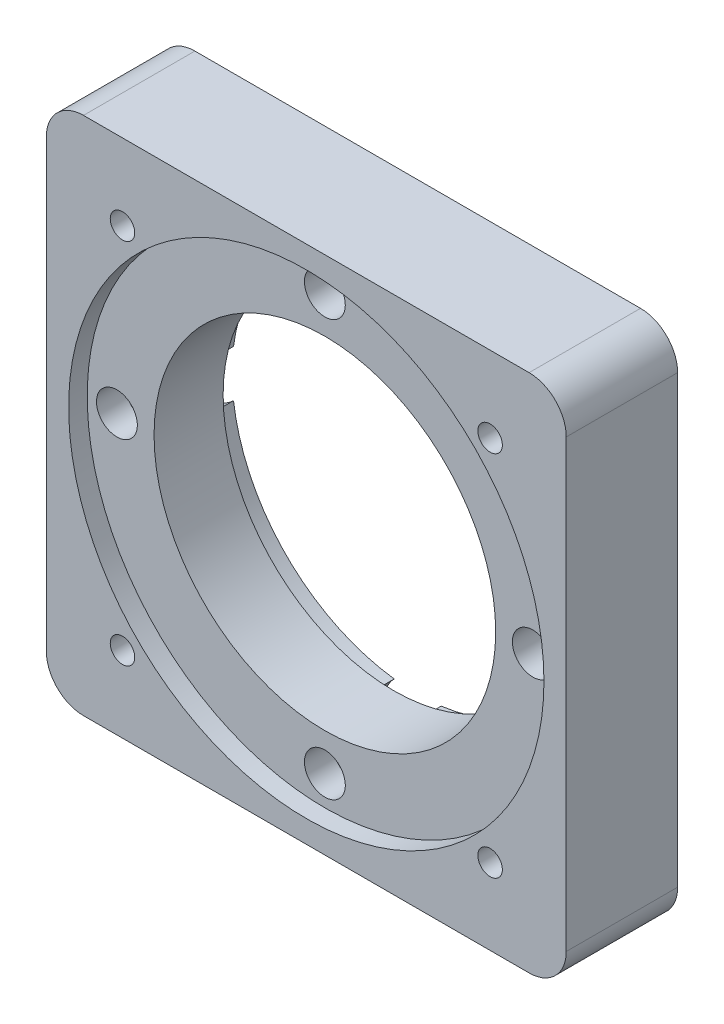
from build123d import *

# Parameters (mm, degrees)
EXTRUDE_1_DEPTH          = 15
SKETCH_2_R               = 32
CUT_EXTRUDE_1_DEPTH      = 2.5
SKETCH_3_R               = 2.75
CUT_EXTRUDE_2_DEPTH      = 12.5
SKETCH_4_R               = 4.5
CUT_EXTRUDE_3_DEPTH      = 8.65
PATTERN_CIRCULAR_1_COUNT = 4
SKETCH_6_R               = 23
CUT_EXTRUDE_5_DEPTH      = 13.5
HOLE_WIZARD_M4_2_D       = 3.3
HOLE_WIZARD_M4_2_DEPTH   = 16.8
HOLE_WIZARD_M4_2_TIP     = 0.991420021
SKETCH_11_R              = 25
CUT_EXTRUDE_6_DEPTH      = 3.2


with BuildPart() as part:
    # Sketch 1 → Extrude 1 (new body)
    with BuildSketch(Plane.XY):
        with BuildLine():
            Line((-30, -35), (30, -35))
            ThreePointArc((30, -35), (33.535533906, -33.535533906), (35, -30))
            Line((35, -30), (35, 30))
            ThreePointArc((35, 30), (33.535533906, 33.535533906), (30, 35))
            Line((30, 35), (-30, 35))
            ThreePointArc((-30, 35), (-33.535533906, 33.535533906), (-35, 30))
            Line((-35, 30), (-35, -30))
            ThreePointArc((-35, -30), (-33.535533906, -33.535533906), (-30, -35))
        make_face()
    extrude(amount=EXTRUDE_1_DEPTH)

    # Sketch 2 → Cut-Extrude 1 (cut)
    with BuildSketch(Plane.XY.offset(15)):
        Circle(SKETCH_2_R)
    extrude(amount=-CUT_EXTRUDE_1_DEPTH, mode=Mode.SUBTRACT)

    # Sketch 3 → Cut-Extrude 2 (cut)
    with BuildSketch(Plane.XY.offset(12.5)):
        with Locations((0, 28)):
            Circle(SKETCH_3_R)
    cut_extrude_2 = extrude(amount=-CUT_EXTRUDE_2_DEPTH, mode=Mode.SUBTRACT)

    # Sketch 4 → Cut-Extrude 3 (cut)
    with BuildSketch(Plane(origin=(0, 0, 0), x_dir=(-1, 0, 0), z_dir=(0, 0, -1))):
        with Locations((0, 28)):
            Circle(SKETCH_4_R)
    cut_extrude_3 = extrude(amount=-CUT_EXTRUDE_3_DEPTH, mode=Mode.SUBTRACT)

    # Pattern Circular 1: Cut-Extrude 2, Cut-Extrude 3 ×4 about axis
    pattern_circular_1_axis = Axis((0, 0, 0), (0, 0, 1))
    add([cut_extrude_2.rotate(pattern_circular_1_axis, i * 360 / PATTERN_CIRCULAR_1_COUNT) for i in range(1, PATTERN_CIRCULAR_1_COUNT)], mode=Mode.SUBTRACT)
    add([cut_extrude_3.rotate(pattern_circular_1_axis, i * 360 / PATTERN_CIRCULAR_1_COUNT) for i in range(1, PATTERN_CIRCULAR_1_COUNT)], mode=Mode.SUBTRACT)

    # Sketch 6 → Cut-Extrude 5 (cut)
    with BuildSketch(Plane.XY.offset(12.5)):
        Circle(SKETCH_6_R)
    extrude(amount=-CUT_EXTRUDE_5_DEPTH, mode=Mode.SUBTRACT)

    # Hole Wizard M4 _2
    with Locations(Plane(origin=(0, 0, 0), x_dir=(-1, 0, 0), z_dir=(0, 0, -1))):
        with Locations((-24.75, 24.75), (24.75, 24.75), (24.75, -24.75), (-24.75, -24.75)):
            Hole(HOLE_WIZARD_M4_2_D / 2, depth=HOLE_WIZARD_M4_2_DEPTH)
            with Locations((0, 0, -(HOLE_WIZARD_M4_2_DEPTH + HOLE_WIZARD_M4_2_TIP / 2))):  # 118° drill point
                Cone(0, HOLE_WIZARD_M4_2_D / 2, HOLE_WIZARD_M4_2_TIP, mode=Mode.SUBTRACT)

    # Sketch 11 → Cut-Extrude 6 (cut)
    with BuildSketch(Plane(origin=(0, 0, 0), x_dir=(-1, 0, 0), z_dir=(0, 0, -1))):
        Circle(SKETCH_11_R)
    extrude(amount=-CUT_EXTRUDE_6_DEPTH, mode=Mode.SUBTRACT)


solid = part.part
